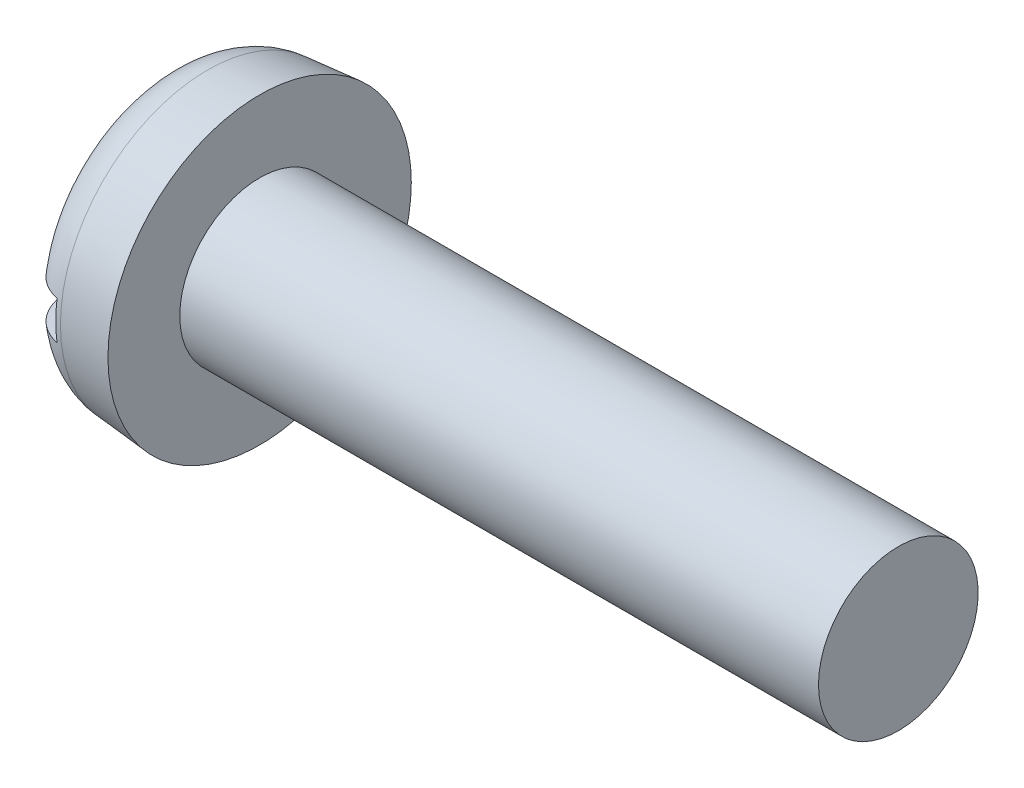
from build123d import *

# Parameters (mm, degrees)
FILLET2_R  = 1.5
SKETCH2_W  = 9.5
SKETCH2_H  = 1.2
SLOT_DEPTH = 1.2


with BuildPart() as part:
    # BodySke → Base-Revolve (revolve)
    with BuildSketch(Plane.XY, mode=Mode.PRIVATE) as base_revolve_sk:
        Polygon((3, 2.5), (3, 4.75), (0, 4.487534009), (0, 0), (23, 0), (23, 2.5), align=None)
    revolve(base_revolve_sk.sketch.rotate(Axis((-25.4, 0, 0), (1, 0, 0)), 90), axis=Axis((-25.4, 0, 0), (1, 0, 0)))

    # Fillet2
    fillet2_edges = [part.edges().sort_by_distance(p)[0] for p in [
        (0, 0, -4.487534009),
    ]]
    fillet(fillet2_edges, radius=FILLET2_R)

    # Sketch2 → Slot (cut)
    with BuildSketch(Plane(origin=(0, 0, 0), x_dir=(0, 0, -1), z_dir=(1, 0, 0))):
        Rectangle(SKETCH2_W, SKETCH2_H)
    extrude(amount=SLOT_DEPTH, mode=Mode.SUBTRACT)


solid = part.part
